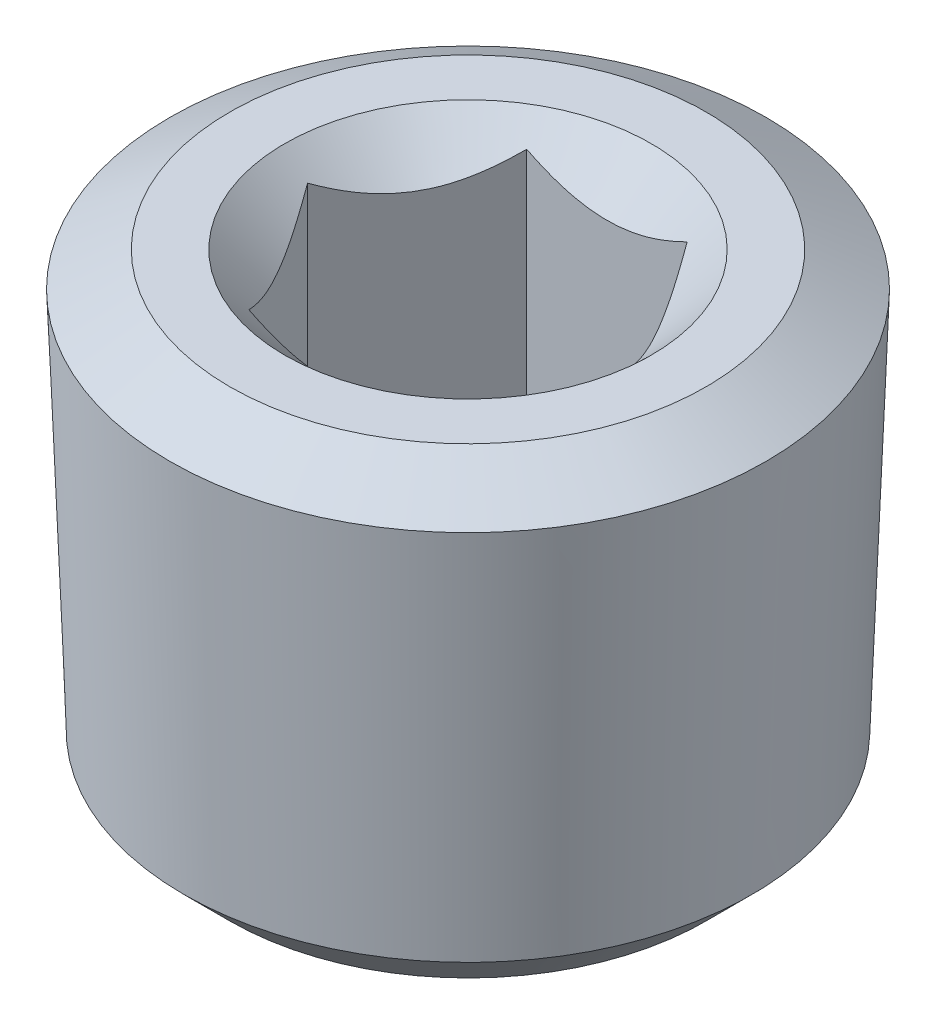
ISO-10303-21;
HEADER;
FILE_DESCRIPTION(('STEP AP214'),'2;1');
FILE_NAME('part.step','',(''),(''),'','','');
FILE_SCHEMA(('AUTOMOTIVE_DESIGN { 1 0 10303 214 1 1 1 1 }'));
ENDSEC;
DATA;
#1=APPLICATION_CONTEXT('core data for automotive mechanical design processes');
#2=APPLICATION_PROTOCOL_DEFINITION('international standard','automotive_design',2000,#1);
#3=PRODUCT_CONTEXT('',#1,'mechanical');
#4=PRODUCT('Part','Part','',(#3));
#5=PRODUCT_RELATED_PRODUCT_CATEGORY('part','',(#4));
#6=PRODUCT_DEFINITION_FORMATION('','',#4);
#7=PRODUCT_DEFINITION_CONTEXT('part definition',#1,'design');
#8=PRODUCT_DEFINITION('design','',#6,#7);
#9=PRODUCT_DEFINITION_SHAPE('','',#8);
#10=(LENGTH_UNIT() NAMED_UNIT(*) SI_UNIT(.MILLI.,.METRE.));
#11=(NAMED_UNIT(*) PLANE_ANGLE_UNIT() SI_UNIT($,.RADIAN.));
#12=(NAMED_UNIT(*) SI_UNIT($,.STERADIAN.) SOLID_ANGLE_UNIT());
#13=UNCERTAINTY_MEASURE_WITH_UNIT(LENGTH_MEASURE(1.E-05),#10,'distance_accuracy_value','');
#14=(GEOMETRIC_REPRESENTATION_CONTEXT(3) GLOBAL_UNCERTAINTY_ASSIGNED_CONTEXT((#13)) GLOBAL_UNIT_ASSIGNED_CONTEXT((#10,
#11,#12)) REPRESENTATION_CONTEXT('',''));
#15=CARTESIAN_POINT('',(0.,0.,0.));
#16=DIRECTION('',(0.,0.,1.));
#17=DIRECTION('',(1.,0.,0.));
#18=AXIS2_PLACEMENT_3D('',#15,#16,#17);
#19=CARTESIAN_POINT('',(0.,0.,0.));
#20=DIRECTION('',(0.,1.,0.));
#21=DIRECTION('',(0.,0.,1.));
#22=AXIS2_PLACEMENT_3D('',#19,#20,#21);
#23=PLANE('',#22);
#24=CARTESIAN_POINT('',(0.,0.,0.));
#25=DIRECTION('',(0.,1.,0.));
#26=DIRECTION('',(0.,0.,1.));
#27=AXIS2_PLACEMENT_3D('',#24,#25,#26);
#28=CIRCLE('',#27,3.1496);
#29=CARTESIAN_POINT('',(0.,0.,3.1496));
#30=VERTEX_POINT('',#29);
#31=EDGE_CURVE('E238',#30,#30,#28,.T.);
#32=ORIENTED_EDGE('',*,*,#31,.F.);
#33=EDGE_LOOP('',(#32));
#34=FACE_BOUND('',#33,.T.);
#35=CARTESIAN_POINT('',(0.,0.,0.));
#36=DIRECTION('',(0.,1.,0.));
#37=DIRECTION('',(0.,0.,1.));
#38=AXIS2_PLACEMENT_3D('',#35,#36,#37);
#39=CIRCLE('',#38,4.09164671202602);
#40=CARTESIAN_POINT('',(0.,0.,4.09164671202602));
#41=VERTEX_POINT('',#40);
#42=EDGE_CURVE('E12',#41,#41,#39,.T.);
#43=ORIENTED_EDGE('',*,*,#42,.T.);
#44=EDGE_LOOP('',(#43));
#45=FACE_BOUND('',#44,.T.);
#46=ADVANCED_FACE('F33',(#34,#45),#23,.T.);
#47=CARTESIAN_POINT('',(0.,0.,0.));
#48=DIRECTION('',(0.,-1.,0.));
#49=DIRECTION('',(0.,0.,-1.));
#50=AXIS2_PLACEMENT_3D('',#47,#48,#49);
#51=CONICAL_SURFACE('',#50,4.09164671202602,1.0471975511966);
#52=CARTESIAN_POINT('',(0.,-0.594768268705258,0.));
#53=DIRECTION('',(0.,1.,0.));
#54=DIRECTION('',(0.,0.,1.));
#55=AXIS2_PLACEMENT_3D('',#52,#53,#54);
#56=CIRCLE('',#55,5.1218155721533);
#57=CARTESIAN_POINT('',(0.,-0.594768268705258,5.1218155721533));
#58=VERTEX_POINT('',#57);
#59=EDGE_CURVE('E40',#58,#58,#56,.T.);
#60=ORIENTED_EDGE('',*,*,#59,.T.);
#61=EDGE_LOOP('',(#60));
#62=FACE_BOUND('',#61,.T.);
#63=ORIENTED_EDGE('',*,*,#42,.F.);
#64=EDGE_LOOP('',(#63));
#65=FACE_BOUND('',#64,.T.);
#66=ADVANCED_FACE('F228',(#62,#65),#51,.T.);
#67=CARTESIAN_POINT('',(0.,-0.594768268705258,0.));
#68=DIRECTION('',(0.,1.,0.));
#69=DIRECTION('',(0.,0.,1.));
#70=AXIS2_PLACEMENT_3D('',#67,#68,#69);
#71=CONICAL_SURFACE('',#70,5.1218155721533,0.0364424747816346);
#72=CARTESIAN_POINT('',(0.,-7.15936733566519,0.));
#73=DIRECTION('',(0.,1.,0.));
#74=DIRECTION('',(0.,0.,1.));
#75=AXIS2_PLACEMENT_3D('',#72,#73,#74);
#76=CIRCLE('',#75,4.88247937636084);
#77=CARTESIAN_POINT('',(0.,-7.15936733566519,4.88247937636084));
#78=VERTEX_POINT('',#77);
#79=EDGE_CURVE('E246',#78,#78,#76,.T.);
#80=ORIENTED_EDGE('',*,*,#79,.T.);
#81=EDGE_LOOP('',(#80));
#82=FACE_BOUND('',#81,.T.);
#83=ORIENTED_EDGE('',*,*,#59,.F.);
#84=EDGE_LOOP('',(#83));
#85=FACE_BOUND('',#84,.T.);
#86=ADVANCED_FACE('F233',(#82,#85),#71,.T.);
#87=CARTESIAN_POINT('',(0.,-7.15936733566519,0.));
#88=DIRECTION('',(0.,1.,0.));
#89=DIRECTION('',(0.,0.,1.));
#90=AXIS2_PLACEMENT_3D('',#87,#88,#89);
#91=CONICAL_SURFACE('',#90,4.88247937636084,0.785398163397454);
#92=CARTESIAN_POINT('',(0.,-7.9502,0.));
#93=DIRECTION('',(0.,1.,0.));
#94=DIRECTION('',(0.,0.,1.));
#95=AXIS2_PLACEMENT_3D('',#92,#93,#94);
#96=CIRCLE('',#95,4.09164671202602);
#97=CARTESIAN_POINT('',(0.,-7.9502,4.09164671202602));
#98=VERTEX_POINT('',#97);
#99=EDGE_CURVE('E242',#98,#98,#96,.T.);
#100=ORIENTED_EDGE('',*,*,#99,.T.);
#101=EDGE_LOOP('',(#100));
#102=FACE_BOUND('',#101,.T.);
#103=ORIENTED_EDGE('',*,*,#79,.F.);
#104=EDGE_LOOP('',(#103));
#105=FACE_BOUND('',#104,.T.);
#106=ADVANCED_FACE('F257',(#102,#105),#91,.T.);
#107=CARTESIAN_POINT('',(-4.09164671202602,-7.9502,0.));
#108=DIRECTION('',(0.,-1.,0.));
#109=DIRECTION('',(0.,0.,-1.));
#110=AXIS2_PLACEMENT_3D('',#107,#108,#109);
#111=PLANE('',#110);
#112=ORIENTED_EDGE('',*,*,#99,.F.);
#113=EDGE_LOOP('',(#112));
#114=FACE_BOUND('',#113,.T.);
#115=ADVANCED_FACE('F175',(#114),#111,.T.);
#116=CARTESIAN_POINT('',(0.,0.,0.));
#117=DIRECTION('',(0.,1.,0.));
#118=DIRECTION('',(0.,0.,1.));
#119=AXIS2_PLACEMENT_3D('',#116,#117,#118);
#120=CONICAL_SURFACE('',#119,3.1496,0.785398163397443);
#121=CARTESIAN_POINT('',(-3.46242077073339,1.05622826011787,2.3876));
#122=CARTESIAN_POINT('',(-3.37526911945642,0.984499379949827,2.3876));
#123=CARTESIAN_POINT('',(-3.28770245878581,0.913266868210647,2.3876));
#124=CARTESIAN_POINT('',(-3.11152582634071,0.772059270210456,2.3876));
#125=CARTESIAN_POINT('',(-3.02291559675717,0.702084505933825,2.3876));
#126=CARTESIAN_POINT('',(-2.84349874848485,0.562930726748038,2.3876));
#127=CARTESIAN_POINT('',(-2.75267868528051,0.493768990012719,2.3876));
#128=CARTESIAN_POINT('',(-2.56954860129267,0.357460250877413,2.3876));
#129=CARTESIAN_POINT('',(-2.47723872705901,0.290313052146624,2.3876));
#130=CARTESIAN_POINT('',(-2.28188792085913,0.152280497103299,2.3876));
#131=CARTESIAN_POINT('',(-2.17866480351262,0.0816515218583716,2.3876));
#132=CARTESIAN_POINT('',(-1.96947715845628,-0.0555359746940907,2.3876));
#133=CARTESIAN_POINT('',(-1.86351173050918,-0.122093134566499,2.3876));
#134=CARTESIAN_POINT('',(-1.64874800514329,-0.249332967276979,2.3876));
#135=CARTESIAN_POINT('',(-1.53996523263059,-0.310041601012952,2.3876));
#136=CARTESIAN_POINT('',(-1.31849805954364,-0.423788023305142,2.3876));
#137=CARTESIAN_POINT('',(-1.20581720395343,-0.476832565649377,2.3876));
#138=CARTESIAN_POINT('',(-1.00970710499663,-0.558326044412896,2.3876));
#139=CARTESIAN_POINT('',(-0.92738768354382,-0.589426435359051,2.3876));
#140=CARTESIAN_POINT('',(-0.760502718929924,-0.645041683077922,2.3876));
#141=CARTESIAN_POINT('',(-0.675936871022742,-0.669555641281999,2.3876));
#142=CARTESIAN_POINT('',(-0.506786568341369,-0.710155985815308,2.3876));
#143=CARTESIAN_POINT('',(-0.422245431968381,-0.726419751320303,2.3876));
#144=CARTESIAN_POINT('',(-0.251935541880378,-0.750223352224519,2.3876));
#145=CARTESIAN_POINT('',(-0.166167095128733,-0.757765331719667,2.3876));
#146=CARTESIAN_POINT('',(0.00107034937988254,-0.763383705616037,2.3876));
#147=CARTESIAN_POINT('',(0.0825230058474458,-0.761946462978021,2.3876));
#148=CARTESIAN_POINT('',(0.244859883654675,-0.750844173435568,2.3876));
#149=CARTESIAN_POINT('',(0.325744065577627,-0.741178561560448,2.3876));
#150=CARTESIAN_POINT('',(0.487775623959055,-0.71402033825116,2.3876));
#151=CARTESIAN_POINT('',(0.568897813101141,-0.696379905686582,2.3876));
#152=CARTESIAN_POINT('',(0.729317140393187,-0.654295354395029,2.3876));
#153=CARTESIAN_POINT('',(0.808614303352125,-0.629851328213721,2.3876));
#154=CARTESIAN_POINT('',(1.04680074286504,-0.546928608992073,2.3876));
#155=CARTESIAN_POINT('',(1.20258605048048,-0.479514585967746,2.3876));
#156=CARTESIAN_POINT('',(1.43061079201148,-0.36699056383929,2.3876));
#157=CARTESIAN_POINT('',(1.50581378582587,-0.32749643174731,2.3876));
#158=CARTESIAN_POINT('',(1.65452246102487,-0.245425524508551,2.3876));
#159=CARTESIAN_POINT('',(1.72802843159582,-0.202849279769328,2.3876));
#160=CARTESIAN_POINT('',(1.86994165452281,-0.117394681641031,2.3876));
#161=CARTESIAN_POINT('',(1.93842134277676,-0.0746352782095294,2.3876));
#162=CARTESIAN_POINT('',(2.07420549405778,0.0127190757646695,2.3876));
#163=CARTESIAN_POINT('',(2.14150986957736,0.0573141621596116,2.3876));
#164=CARTESIAN_POINT('',(2.27455924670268,0.147653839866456,2.3876));
#165=CARTESIAN_POINT('',(2.34031238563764,0.19338649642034,2.3876));
#166=CARTESIAN_POINT('',(2.47091456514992,0.286088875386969,2.3876));
#167=CARTESIAN_POINT('',(2.53576384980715,0.333058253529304,2.3876));
#168=CARTESIAN_POINT('',(2.60023368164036,0.380534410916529,2.3876));
#169=B_SPLINE_CURVE_WITH_KNOTS('',3,(#121,#122,#123,#124,#125,#126,#127,#128,#129,#130,#131,
#132,#133,#134,#135,#136,#137,#138,#139,#140,#141,#142,#143,#144,#145,#146,#147,#148,#149,#150,
#151,#152,#153,#154,#155,#156,#157,#158,#159,#160,#161,#162,#163,#164,#165,#166,#167,#168),
.UNSPECIFIED.,.F.,.F.,(4,2,2,2,2,2,2,2,2,2,2,2,2,2,2,2,2,2,2,2,2,2,2,4),(0.,0.33862629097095,
0.677338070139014,1.01978408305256,1.3621966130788,1.73734628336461,2.11262070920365,
2.48614413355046,2.85933636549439,3.12311223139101,3.38692406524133,3.64479404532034,
3.90260061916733,4.14656864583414,4.39055342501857,4.6392589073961,4.88796100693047,
5.39563913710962,5.65044461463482,5.90520634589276,6.14737581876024,6.38956324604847,
6.62982819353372,6.87002695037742),.UNSPECIFIED.);
#170=CARTESIAN_POINT('',(1.37848150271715,-0.392636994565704,2.3876));
#171=VERTEX_POINT('',#170);
#172=CARTESIAN_POINT('',(-1.37848150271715,-0.392636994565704,2.3876));
#173=VERTEX_POINT('',#172);
#174=EDGE_CURVE('E47',#171,#173,#169,.F.);
#175=ORIENTED_EDGE('',*,*,#174,.T.);
#176=CARTESIAN_POINT('',(-1.37836603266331,-0.392521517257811,2.3878));
#177=CARTESIAN_POINT('',(-1.42575207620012,-0.439867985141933,2.30572496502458));
#178=CARTESIAN_POINT('',(-1.47393048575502,-0.484433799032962,2.22227751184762));
#179=CARTESIAN_POINT('',(-1.57217161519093,-0.566032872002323,2.05211888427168));
#180=CARTESIAN_POINT('',(-1.62224367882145,-0.603020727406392,1.96539152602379));
#181=CARTESIAN_POINT('',(-1.72321161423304,-0.666381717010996,1.79050993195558));
#182=CARTESIAN_POINT('',(-1.77408177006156,-0.692914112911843,1.70240023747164));
#183=CARTESIAN_POINT('',(-1.87694201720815,-0.733792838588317,1.52424106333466));
#184=CARTESIAN_POINT('',(-1.92892896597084,-0.748169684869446,1.4341970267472));
#185=CARTESIAN_POINT('',(-2.01852512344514,-0.761141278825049,1.27901192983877));
#186=CARTESIAN_POINT('',(-2.05601857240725,-0.763061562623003,1.2140713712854));
#187=CARTESIAN_POINT('',(-2.13094418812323,-0.759826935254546,1.08429639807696));
#188=CARTESIAN_POINT('',(-2.16837632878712,-0.754669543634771,1.01946202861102));
#189=CARTESIAN_POINT('',(-2.24288716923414,-0.737573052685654,0.89040546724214));
#190=CARTESIAN_POINT('',(-2.2799654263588,-0.725626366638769,0.826184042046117));
#191=CARTESIAN_POINT('',(-2.35348076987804,-0.695607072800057,0.698851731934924));
#192=CARTESIAN_POINT('',(-2.38991790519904,-0.677534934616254,0.635740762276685));
#193=CARTESIAN_POINT('',(-2.48325004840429,-0.623883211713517,0.474084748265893));
#194=CARTESIAN_POINT('',(-2.53956632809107,-0.584259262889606,0.376542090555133));
#195=CARTESIAN_POINT('',(-2.62237445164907,-0.517368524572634,0.233114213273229));
#196=CARTESIAN_POINT('',(-2.64966342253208,-0.493866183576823,0.1858483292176));
#197=CARTESIAN_POINT('',(-2.70373586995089,-0.444719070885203,0.092192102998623));
#198=CARTESIAN_POINT('',(-2.73051964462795,-0.419075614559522,0.0458012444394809));
#199=CARTESIAN_POINT('',(-2.75707847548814,-0.39252151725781,-0.000199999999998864));
#200=B_SPLINE_CURVE_WITH_KNOTS('',3,(#176,#177,#178,#179,#180,#181,#182,#183,#184,#185,#186,
#187,#188,#189,#190,#191,#192,#193,#194,#195,#196,#197,#198,#199),.UNSPECIFIED.,.F.,.F.,(4,2,2,
2,2,2,2,2,2,2,2,4),(0.,0.318042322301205,0.637937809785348,0.952752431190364,1.26677434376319,
1.49149028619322,1.71628500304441,1.94133141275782,2.16636057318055,2.52380766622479,
2.70204658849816,2.88017680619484),.UNSPECIFIED.);
#201=CARTESIAN_POINT('',(-2.7569630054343,-0.392636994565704,0.));
#202=VERTEX_POINT('',#201);
#203=EDGE_CURVE('E119',#173,#202,#200,.T.);
#204=ORIENTED_EDGE('',*,*,#203,.T.);
#205=CARTESIAN_POINT('',(-2.75707847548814,-0.39252151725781,0.000200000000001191));
#206=CARTESIAN_POINT('',(-2.70969243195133,-0.439867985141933,-0.0818750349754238));
#207=CARTESIAN_POINT('',(-2.66151402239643,-0.484433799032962,-0.165322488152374));
#208=CARTESIAN_POINT('',(-2.56327289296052,-0.566032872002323,-0.335481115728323));
#209=CARTESIAN_POINT('',(-2.51320082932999,-0.603020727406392,-0.422208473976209));
#210=CARTESIAN_POINT('',(-2.4122328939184,-0.666381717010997,-0.597090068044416));
#211=CARTESIAN_POINT('',(-2.36136273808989,-0.692914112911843,-0.685199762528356));
#212=CARTESIAN_POINT('',(-2.2585024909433,-0.733792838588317,-0.863358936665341));
#213=CARTESIAN_POINT('',(-2.2065155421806,-0.748169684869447,-0.953402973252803));
#214=CARTESIAN_POINT('',(-2.1169193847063,-0.76114127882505,-1.10858807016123));
#215=CARTESIAN_POINT('',(-2.07942593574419,-0.763061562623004,-1.1735286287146));
#216=CARTESIAN_POINT('',(-2.00450032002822,-0.759826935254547,-1.30330360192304));
#217=CARTESIAN_POINT('',(-1.96706817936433,-0.754669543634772,-1.36813797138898));
#218=CARTESIAN_POINT('',(-1.89255733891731,-0.737573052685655,-1.49719453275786));
#219=CARTESIAN_POINT('',(-1.85547908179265,-0.725626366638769,-1.56141595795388));
#220=CARTESIAN_POINT('',(-1.78196373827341,-0.695607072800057,-1.68874826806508));
#221=CARTESIAN_POINT('',(-1.74552660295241,-0.677534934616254,-1.75185923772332));
#222=CARTESIAN_POINT('',(-1.65219445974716,-0.623883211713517,-1.91351525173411));
#223=CARTESIAN_POINT('',(-1.59587818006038,-0.584259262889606,-2.01105790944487));
#224=CARTESIAN_POINT('',(-1.51307005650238,-0.517368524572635,-2.15448578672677));
#225=CARTESIAN_POINT('',(-1.48578108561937,-0.493866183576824,-2.2017516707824));
#226=CARTESIAN_POINT('',(-1.43170863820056,-0.444719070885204,-2.29540789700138));
#227=CARTESIAN_POINT('',(-1.4049248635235,-0.419075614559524,-2.34179875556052));
#228=CARTESIAN_POINT('',(-1.37836603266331,-0.392521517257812,-2.3878));
#229=B_SPLINE_CURVE_WITH_KNOTS('',3,(#205,#206,#207,#208,#209,#210,#211,#212,#213,#214,#215,
#216,#217,#218,#219,#220,#221,#222,#223,#224,#225,#226,#227,#228),.UNSPECIFIED.,.F.,.F.,(4,2,2,
2,2,2,2,2,2,2,2,4),(0.,0.318042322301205,0.637937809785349,0.952752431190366,1.26677434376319,
1.49149028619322,1.71628500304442,1.94133141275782,2.16636057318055,2.52380766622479,
2.70204658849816,2.88017680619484),.UNSPECIFIED.);
#230=CARTESIAN_POINT('',(-1.37848150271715,-0.392636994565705,-2.3876));
#231=VERTEX_POINT('',#230);
#232=EDGE_CURVE('E197',#202,#231,#229,.T.);
#233=ORIENTED_EDGE('',*,*,#232,.T.);
#234=CARTESIAN_POINT('',(-3.46242077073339,1.05622826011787,-2.3876));
#235=CARTESIAN_POINT('',(-3.37526911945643,0.984499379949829,-2.3876));
#236=CARTESIAN_POINT('',(-3.28770245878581,0.91326686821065,-2.3876));
#237=CARTESIAN_POINT('',(-3.11152582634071,0.772059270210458,-2.3876));
#238=CARTESIAN_POINT('',(-3.02291559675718,0.702084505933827,-2.3876));
#239=CARTESIAN_POINT('',(-2.84349874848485,0.56293072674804,-2.3876));
#240=CARTESIAN_POINT('',(-2.75267868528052,0.49376899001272,-2.3876));
#241=CARTESIAN_POINT('',(-2.56954860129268,0.357460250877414,-2.3876));
#242=CARTESIAN_POINT('',(-2.47723872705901,0.290313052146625,-2.3876));
#243=CARTESIAN_POINT('',(-2.28188792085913,0.1522804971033,-2.3876));
#244=CARTESIAN_POINT('',(-2.17866480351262,0.081651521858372,-2.3876));
#245=CARTESIAN_POINT('',(-1.96947715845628,-0.0555359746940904,-2.3876));
#246=CARTESIAN_POINT('',(-1.86351173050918,-0.122093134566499,-2.3876));
#247=CARTESIAN_POINT('',(-1.64874800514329,-0.249332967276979,-2.3876));
#248=CARTESIAN_POINT('',(-1.53996523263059,-0.310041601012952,-2.3876));
#249=CARTESIAN_POINT('',(-1.31849805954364,-0.423788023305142,-2.3876));
#250=CARTESIAN_POINT('',(-1.20581720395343,-0.476832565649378,-2.3876));
#251=CARTESIAN_POINT('',(-1.00970710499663,-0.558326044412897,-2.3876));
#252=CARTESIAN_POINT('',(-0.92738768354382,-0.589426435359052,-2.3876));
#253=CARTESIAN_POINT('',(-0.760502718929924,-0.645041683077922,-2.3876));
#254=CARTESIAN_POINT('',(-0.675936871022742,-0.669555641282,-2.3876));
#255=CARTESIAN_POINT('',(-0.506786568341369,-0.710155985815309,-2.3876));
#256=CARTESIAN_POINT('',(-0.422245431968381,-0.726419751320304,-2.3876));
#257=CARTESIAN_POINT('',(-0.251935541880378,-0.750223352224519,-2.3876));
#258=CARTESIAN_POINT('',(-0.166167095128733,-0.757765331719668,-2.3876));
#259=CARTESIAN_POINT('',(0.00107034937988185,-0.763383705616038,-2.3876));
#260=CARTESIAN_POINT('',(0.0825230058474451,-0.761946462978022,-2.3876));
#261=CARTESIAN_POINT('',(0.244859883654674,-0.750844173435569,-2.3876));
#262=CARTESIAN_POINT('',(0.325744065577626,-0.741178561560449,-2.3876));
#263=CARTESIAN_POINT('',(0.487775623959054,-0.714020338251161,-2.3876));
#264=CARTESIAN_POINT('',(0.56889781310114,-0.696379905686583,-2.3876));
#265=CARTESIAN_POINT('',(0.729317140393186,-0.65429535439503,-2.3876));
#266=CARTESIAN_POINT('',(0.808614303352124,-0.629851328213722,-2.3876));
#267=CARTESIAN_POINT('',(1.04680074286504,-0.546928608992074,-2.3876));
#268=CARTESIAN_POINT('',(1.20258605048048,-0.479514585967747,-2.3876));
#269=CARTESIAN_POINT('',(1.43061079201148,-0.366990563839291,-2.3876));
#270=CARTESIAN_POINT('',(1.50581378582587,-0.327496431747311,-2.3876));
#271=CARTESIAN_POINT('',(1.65452246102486,-0.245425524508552,-2.3876));
#272=CARTESIAN_POINT('',(1.72802843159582,-0.202849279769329,-2.3876));
#273=CARTESIAN_POINT('',(1.86994165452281,-0.117394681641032,-2.3876));
#274=CARTESIAN_POINT('',(1.93842134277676,-0.0746352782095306,-2.3876));
#275=CARTESIAN_POINT('',(2.07420549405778,0.0127190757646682,-2.3876));
#276=CARTESIAN_POINT('',(2.14150986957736,0.0573141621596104,-2.3876));
#277=CARTESIAN_POINT('',(2.27455924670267,0.147653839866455,-2.3876));
#278=CARTESIAN_POINT('',(2.34031238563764,0.193386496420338,-2.3876));
#279=CARTESIAN_POINT('',(2.47091456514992,0.286088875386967,-2.3876));
#280=CARTESIAN_POINT('',(2.53576384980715,0.333058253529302,-2.3876));
#281=CARTESIAN_POINT('',(2.60023368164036,0.380534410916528,-2.3876));
#282=B_SPLINE_CURVE_WITH_KNOTS('',3,(#234,#235,#236,#237,#238,#239,#240,#241,#242,#243,#244,
#245,#246,#247,#248,#249,#250,#251,#252,#253,#254,#255,#256,#257,#258,#259,#260,#261,#262,#263,
#264,#265,#266,#267,#268,#269,#270,#271,#272,#273,#274,#275,#276,#277,#278,#279,#280,#281),
.UNSPECIFIED.,.F.,.F.,(4,2,2,2,2,2,2,2,2,2,2,2,2,2,2,2,2,2,2,2,2,2,2,4),(0.,0.338626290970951,
0.677338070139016,1.01978408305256,1.3621966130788,1.73734628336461,2.11262070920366,
2.48614413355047,2.85933636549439,3.12311223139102,3.38692406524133,3.64479404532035,
3.90260061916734,4.14656864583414,4.39055342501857,4.6392589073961,4.88796100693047,
5.39563913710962,5.65044461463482,5.90520634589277,6.14737581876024,6.38956324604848,
6.62982819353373,6.87002695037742),.UNSPECIFIED.);
#283=CARTESIAN_POINT('',(1.37848150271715,-0.392636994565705,-2.3876));
#284=VERTEX_POINT('',#283);
#285=EDGE_CURVE('E191',#231,#284,#282,.T.);
#286=ORIENTED_EDGE('',*,*,#285,.T.);
#287=CARTESIAN_POINT('',(1.37836603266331,-0.392521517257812,-2.3878));
#288=CARTESIAN_POINT('',(1.42575207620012,-0.439867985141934,-2.30572496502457));
#289=CARTESIAN_POINT('',(1.47393048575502,-0.484433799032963,-2.22227751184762));
#290=CARTESIAN_POINT('',(1.57217161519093,-0.566032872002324,-2.05211888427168));
#291=CARTESIAN_POINT('',(1.62224367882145,-0.603020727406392,-1.96539152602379));
#292=CARTESIAN_POINT('',(1.72321161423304,-0.666381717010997,-1.79050993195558));
#293=CARTESIAN_POINT('',(1.77408177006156,-0.692914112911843,-1.70240023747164));
#294=CARTESIAN_POINT('',(1.87694201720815,-0.733792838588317,-1.52424106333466));
#295=CARTESIAN_POINT('',(1.92892896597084,-0.748169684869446,-1.4341970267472));
#296=CARTESIAN_POINT('',(2.01852512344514,-0.761141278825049,-1.27901192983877));
#297=CARTESIAN_POINT('',(2.05601857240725,-0.763061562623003,-1.2140713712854));
#298=CARTESIAN_POINT('',(2.13094418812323,-0.759826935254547,-1.08429639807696));
#299=CARTESIAN_POINT('',(2.16837632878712,-0.754669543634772,-1.01946202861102));
#300=CARTESIAN_POINT('',(2.24288716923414,-0.737573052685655,-0.89040546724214));
#301=CARTESIAN_POINT('',(2.2799654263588,-0.725626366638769,-0.826184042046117));
#302=CARTESIAN_POINT('',(2.35348076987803,-0.695607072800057,-0.698851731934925));
#303=CARTESIAN_POINT('',(2.38991790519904,-0.677534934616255,-0.635740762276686));
#304=CARTESIAN_POINT('',(2.48325004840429,-0.623883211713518,-0.474084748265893));
#305=CARTESIAN_POINT('',(2.53956632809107,-0.584259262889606,-0.376542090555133));
#306=CARTESIAN_POINT('',(2.62237445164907,-0.517368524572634,-0.233114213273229));
#307=CARTESIAN_POINT('',(2.64966342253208,-0.493866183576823,-0.1858483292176));
#308=CARTESIAN_POINT('',(2.70373586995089,-0.444719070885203,-0.0921921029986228));
#309=CARTESIAN_POINT('',(2.73051964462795,-0.419075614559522,-0.0458012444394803));
#310=CARTESIAN_POINT('',(2.75707847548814,-0.39252151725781,0.000199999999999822));
#311=B_SPLINE_CURVE_WITH_KNOTS('',3,(#287,#288,#289,#290,#291,#292,#293,#294,#295,#296,#297,
#298,#299,#300,#301,#302,#303,#304,#305,#306,#307,#308,#309,#310),.UNSPECIFIED.,.F.,.F.,(4,2,2,
2,2,2,2,2,2,2,2,4),(0.,0.318042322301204,0.637937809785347,0.952752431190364,1.26677434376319,
1.49149028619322,1.71628500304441,1.94133141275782,2.16636057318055,2.52380766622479,
2.70204658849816,2.88017680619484),.UNSPECIFIED.);
#312=CARTESIAN_POINT('',(2.7569630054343,-0.392636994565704,0.));
#313=VERTEX_POINT('',#312);
#314=EDGE_CURVE('E185',#284,#313,#311,.T.);
#315=ORIENTED_EDGE('',*,*,#314,.T.);
#316=CARTESIAN_POINT('',(2.75707847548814,-0.39252151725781,-0.000200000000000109));
#317=CARTESIAN_POINT('',(2.70969243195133,-0.439867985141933,0.0818750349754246));
#318=CARTESIAN_POINT('',(2.66151402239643,-0.484433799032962,0.165322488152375));
#319=CARTESIAN_POINT('',(2.56327289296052,-0.566032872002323,0.335481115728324));
#320=CARTESIAN_POINT('',(2.51320082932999,-0.603020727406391,0.422208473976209));
#321=CARTESIAN_POINT('',(2.4122328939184,-0.666381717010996,0.597090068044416));
#322=CARTESIAN_POINT('',(2.36136273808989,-0.692914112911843,0.685199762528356));
#323=CARTESIAN_POINT('',(2.2585024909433,-0.733792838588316,0.863358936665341));
#324=CARTESIAN_POINT('',(2.20651554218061,-0.748169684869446,0.953402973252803));
#325=CARTESIAN_POINT('',(2.11691938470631,-0.761141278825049,1.10858807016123));
#326=CARTESIAN_POINT('',(2.0794259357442,-0.763061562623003,1.1735286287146));
#327=CARTESIAN_POINT('',(2.00450032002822,-0.759826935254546,1.30330360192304));
#328=CARTESIAN_POINT('',(1.96706817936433,-0.754669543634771,1.36813797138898));
#329=CARTESIAN_POINT('',(1.89255733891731,-0.737573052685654,1.49719453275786));
#330=CARTESIAN_POINT('',(1.85547908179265,-0.725626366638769,1.56141595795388));
#331=CARTESIAN_POINT('',(1.78196373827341,-0.695607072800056,1.68874826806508));
#332=CARTESIAN_POINT('',(1.74552660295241,-0.677534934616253,1.75185923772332));
#333=CARTESIAN_POINT('',(1.65219445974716,-0.623883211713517,1.91351525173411));
#334=CARTESIAN_POINT('',(1.59587818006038,-0.584259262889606,2.01105790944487));
#335=CARTESIAN_POINT('',(1.51307005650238,-0.517368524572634,2.15448578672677));
#336=CARTESIAN_POINT('',(1.48578108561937,-0.493866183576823,2.2017516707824));
#337=CARTESIAN_POINT('',(1.43170863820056,-0.444719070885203,2.29540789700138));
#338=CARTESIAN_POINT('',(1.4049248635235,-0.419075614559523,2.34179875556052));
#339=CARTESIAN_POINT('',(1.37836603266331,-0.39252151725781,2.3878));
#340=B_SPLINE_CURVE_WITH_KNOTS('',3,(#316,#317,#318,#319,#320,#321,#322,#323,#324,#325,#326,
#327,#328,#329,#330,#331,#332,#333,#334,#335,#336,#337,#338,#339),.UNSPECIFIED.,.F.,.F.,(4,2,2,
2,2,2,2,2,2,2,2,4),(0.,0.318042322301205,0.637937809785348,0.952752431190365,1.26677434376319,
1.49149028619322,1.71628500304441,1.94133141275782,2.16636057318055,2.52380766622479,
2.70204658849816,2.88017680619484),.UNSPECIFIED.);
#341=EDGE_CURVE('E162',#313,#171,#340,.T.);
#342=ORIENTED_EDGE('',*,*,#341,.T.);
#343=EDGE_LOOP('',(#175,#204,#233,#286,#315,#342));
#344=FACE_BOUND('',#343,.T.);
#345=ORIENTED_EDGE('',*,*,#31,.T.);
#346=EDGE_LOOP('',(#345));
#347=FACE_BOUND('',#346,.T.);
#348=ADVANCED_FACE('F170',(#344,#347),#120,.F.);
#349=CARTESIAN_POINT('',(-2.7569630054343,-6.35,0.));
#350=DIRECTION('',(-0.866025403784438,0.,0.5));
#351=DIRECTION('',(0.500000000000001,0.,0.866025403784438));
#352=AXIS2_PLACEMENT_3D('',#349,#350,#351);
#353=PLANE('',#352);
#354=DIRECTION('',(0.,1.,0.));
#355=VECTOR('',#354,1.);
#356=CARTESIAN_POINT('',(-1.37848150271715,-6.35,2.3876));
#357=LINE('',#356,#355);
#358=CARTESIAN_POINT('',(-1.37848150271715,-6.35,2.3876));
#359=VERTEX_POINT('',#358);
#360=EDGE_CURVE('E116',#359,#173,#357,.T.);
#361=ORIENTED_EDGE('',*,*,#360,.F.);
#362=DIRECTION('',(0.5,0.,0.866025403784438));
#363=VECTOR('',#362,1.);
#364=CARTESIAN_POINT('',(-2.7569630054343,-6.35,0.));
#365=LINE('',#364,#363);
#366=CARTESIAN_POINT('',(-2.06772225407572,-6.35,1.1938));
#367=VERTEX_POINT('',#366);
#368=EDGE_CURVE('E103',#367,#359,#365,.T.);
#369=ORIENTED_EDGE('',*,*,#368,.F.);
#370=CARTESIAN_POINT('',(-2.7569630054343,-6.35,0.));
#371=VERTEX_POINT('',#370);
#372=EDGE_CURVE('E113',#371,#367,#365,.T.);
#373=ORIENTED_EDGE('',*,*,#372,.F.);
#374=DIRECTION('',(0.,1.,0.));
#375=VECTOR('',#374,1.);
#376=CARTESIAN_POINT('',(-2.7569630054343,-6.35,0.));
#377=LINE('',#376,#375);
#378=EDGE_CURVE('E143',#371,#202,#377,.T.);
#379=ORIENTED_EDGE('',*,*,#378,.T.);
#380=ORIENTED_EDGE('',*,*,#203,.F.);
#381=EDGE_LOOP('',(#361,#369,#373,#379,#380));
#382=FACE_BOUND('',#381,.T.);
#383=ADVANCED_FACE('F117',(#382),#353,.F.);
#384=CARTESIAN_POINT('',(-1.37848150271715,-6.35,-2.3876));
#385=DIRECTION('',(-0.866025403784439,0.,-0.5));
#386=DIRECTION('',(-0.5,0.,0.866025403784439));
#387=AXIS2_PLACEMENT_3D('',#384,#385,#386);
#388=PLANE('',#387);
#389=ORIENTED_EDGE('',*,*,#378,.F.);
#390=DIRECTION('',(-0.5,0.,0.866025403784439));
#391=VECTOR('',#390,1.);
#392=CARTESIAN_POINT('',(-1.37848150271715,-6.35,-2.3876));
#393=LINE('',#392,#391);
#394=CARTESIAN_POINT('',(-2.06772225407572,-6.35,-1.1938));
#395=VERTEX_POINT('',#394);
#396=EDGE_CURVE('E140',#395,#371,#393,.T.);
#397=ORIENTED_EDGE('',*,*,#396,.F.);
#398=CARTESIAN_POINT('',(-1.37848150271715,-6.35,-2.3876));
#399=VERTEX_POINT('',#398);
#400=EDGE_CURVE('E122',#399,#395,#393,.T.);
#401=ORIENTED_EDGE('',*,*,#400,.F.);
#402=DIRECTION('',(0.,1.,0.));
#403=VECTOR('',#402,1.);
#404=CARTESIAN_POINT('',(-1.37848150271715,-6.35,-2.3876));
#405=LINE('',#404,#403);
#406=EDGE_CURVE('E145',#399,#231,#405,.T.);
#407=ORIENTED_EDGE('',*,*,#406,.T.);
#408=ORIENTED_EDGE('',*,*,#232,.F.);
#409=EDGE_LOOP('',(#389,#397,#401,#407,#408));
#410=FACE_BOUND('',#409,.T.);
#411=ADVANCED_FACE('F206',(#410),#388,.F.);
#412=CARTESIAN_POINT('',(1.37848150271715,-6.35,-2.3876));
#413=DIRECTION('',(0.,0.,-1.));
#414=DIRECTION('',(-1.,0.,0.));
#415=AXIS2_PLACEMENT_3D('',#412,#413,#414);
#416=PLANE('',#415);
#417=ORIENTED_EDGE('',*,*,#406,.F.);
#418=DIRECTION('',(-1.,0.,0.));
#419=VECTOR('',#418,1.);
#420=CARTESIAN_POINT('',(1.37848150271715,-6.35,-2.3876));
#421=LINE('',#420,#419);
#422=CARTESIAN_POINT('',(0.,-6.35,-2.3876));
#423=VERTEX_POINT('',#422);
#424=EDGE_CURVE('E136',#423,#399,#421,.T.);
#425=ORIENTED_EDGE('',*,*,#424,.F.);
#426=CARTESIAN_POINT('',(1.37848150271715,-6.35,-2.3876));
#427=VERTEX_POINT('',#426);
#428=EDGE_CURVE('E137',#427,#423,#421,.T.);
#429=ORIENTED_EDGE('',*,*,#428,.F.);
#430=DIRECTION('',(0.,1.,0.));
#431=VECTOR('',#430,1.);
#432=CARTESIAN_POINT('',(1.37848150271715,-6.35,-2.3876));
#433=LINE('',#432,#431);
#434=EDGE_CURVE('E148',#427,#284,#433,.T.);
#435=ORIENTED_EDGE('',*,*,#434,.T.);
#436=ORIENTED_EDGE('',*,*,#285,.F.);
#437=EDGE_LOOP('',(#417,#425,#429,#435,#436));
#438=FACE_BOUND('',#437,.T.);
#439=ADVANCED_FACE('F210',(#438),#416,.F.);
#440=CARTESIAN_POINT('',(2.7569630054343,-6.35,0.));
#441=DIRECTION('',(0.866025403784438,0.,-0.5));
#442=DIRECTION('',(-0.5,0.,-0.866025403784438));
#443=AXIS2_PLACEMENT_3D('',#440,#441,#442);
#444=PLANE('',#443);
#445=ORIENTED_EDGE('',*,*,#434,.F.);
#446=DIRECTION('',(-0.5,0.,-0.866025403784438));
#447=VECTOR('',#446,1.);
#448=CARTESIAN_POINT('',(2.7569630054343,-6.35,0.));
#449=LINE('',#448,#447);
#450=CARTESIAN_POINT('',(2.06772225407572,-6.35,-1.1938));
#451=VERTEX_POINT('',#450);
#452=EDGE_CURVE('E132',#451,#427,#449,.T.);
#453=ORIENTED_EDGE('',*,*,#452,.F.);
#454=CARTESIAN_POINT('',(2.7569630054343,-6.35,0.));
#455=VERTEX_POINT('',#454);
#456=EDGE_CURVE('E133',#455,#451,#449,.T.);
#457=ORIENTED_EDGE('',*,*,#456,.F.);
#458=DIRECTION('',(0.,1.,0.));
#459=VECTOR('',#458,1.);
#460=CARTESIAN_POINT('',(2.7569630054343,-6.35,0.));
#461=LINE('',#460,#459);
#462=EDGE_CURVE('E151',#455,#313,#461,.T.);
#463=ORIENTED_EDGE('',*,*,#462,.T.);
#464=ORIENTED_EDGE('',*,*,#314,.F.);
#465=EDGE_LOOP('',(#445,#453,#457,#463,#464));
#466=FACE_BOUND('',#465,.T.);
#467=ADVANCED_FACE('F214',(#466),#444,.F.);
#468=CARTESIAN_POINT('',(1.37848150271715,-6.35,2.3876));
#469=DIRECTION('',(0.866025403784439,0.,0.5));
#470=DIRECTION('',(0.5,0.,-0.866025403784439));
#471=AXIS2_PLACEMENT_3D('',#468,#469,#470);
#472=PLANE('',#471);
#473=ORIENTED_EDGE('',*,*,#462,.F.);
#474=DIRECTION('',(0.5,0.,-0.866025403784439));
#475=VECTOR('',#474,1.);
#476=CARTESIAN_POINT('',(1.37848150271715,-6.35,2.3876));
#477=LINE('',#476,#475);
#478=CARTESIAN_POINT('',(2.06772225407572,-6.35,1.1938));
#479=VERTEX_POINT('',#478);
#480=EDGE_CURVE('E128',#479,#455,#477,.T.);
#481=ORIENTED_EDGE('',*,*,#480,.F.);
#482=CARTESIAN_POINT('',(1.37848150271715,-6.35,2.3876));
#483=VERTEX_POINT('',#482);
#484=EDGE_CURVE('E55',#483,#479,#477,.T.);
#485=ORIENTED_EDGE('',*,*,#484,.F.);
#486=DIRECTION('',(0.,1.,0.));
#487=VECTOR('',#486,1.);
#488=CARTESIAN_POINT('',(1.37848150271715,-6.35,2.3876));
#489=LINE('',#488,#487);
#490=EDGE_CURVE('E121',#483,#171,#489,.T.);
#491=ORIENTED_EDGE('',*,*,#490,.T.);
#492=ORIENTED_EDGE('',*,*,#341,.F.);
#493=EDGE_LOOP('',(#473,#481,#485,#491,#492));
#494=FACE_BOUND('',#493,.T.);
#495=ADVANCED_FACE('F218',(#494),#472,.F.);
#496=CARTESIAN_POINT('',(-1.37848150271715,-6.35,2.3876));
#497=DIRECTION('',(0.,0.,1.));
#498=DIRECTION('',(1.,0.,0.));
#499=AXIS2_PLACEMENT_3D('',#496,#497,#498);
#500=PLANE('',#499);
#501=ORIENTED_EDGE('',*,*,#490,.F.);
#502=DIRECTION('',(1.,0.,0.));
#503=VECTOR('',#502,1.);
#504=CARTESIAN_POINT('',(-1.37848150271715,-6.35,2.3876));
#505=LINE('',#504,#503);
#506=CARTESIAN_POINT('',(0.,-6.35,2.3876));
#507=VERTEX_POINT('',#506);
#508=EDGE_CURVE('E127',#507,#483,#505,.T.);
#509=ORIENTED_EDGE('',*,*,#508,.F.);
#510=EDGE_CURVE('E107',#359,#507,#505,.T.);
#511=ORIENTED_EDGE('',*,*,#510,.F.);
#512=ORIENTED_EDGE('',*,*,#360,.T.);
#513=ORIENTED_EDGE('',*,*,#174,.F.);
#514=EDGE_LOOP('',(#501,#509,#511,#512,#513));
#515=FACE_BOUND('',#514,.T.);
#516=ADVANCED_FACE('F126',(#515),#500,.F.);
#517=CARTESIAN_POINT('',(0.,-6.35,0.));
#518=DIRECTION('',(0.,1.,0.));
#519=DIRECTION('',(0.,0.,1.));
#520=AXIS2_PLACEMENT_3D('',#517,#518,#519);
#521=PLANE('',#520);
#522=CARTESIAN_POINT('',(0.,-6.35,0.));
#523=DIRECTION('',(0.,1.,0.));
#524=DIRECTION('',(0.,0.,1.));
#525=AXIS2_PLACEMENT_3D('',#522,#523,#524);
#526=CIRCLE('',#525,2.3876);
#527=EDGE_CURVE('E109',#367,#507,#526,.T.);
#528=ORIENTED_EDGE('',*,*,#527,.F.);
#529=ORIENTED_EDGE('',*,*,#368,.T.);
#530=ORIENTED_EDGE('',*,*,#510,.T.);
#531=EDGE_LOOP('',(#528,#529,#530));
#532=FACE_BOUND('',#531,.T.);
#533=ADVANCED_FACE('F105',(#532),#521,.T.);
#534=EDGE_CURVE('E408',#395,#367,#526,.T.);
#535=ORIENTED_EDGE('',*,*,#534,.F.);
#536=ORIENTED_EDGE('',*,*,#396,.T.);
#537=ORIENTED_EDGE('',*,*,#372,.T.);
#538=EDGE_LOOP('',(#535,#536,#537));
#539=FACE_BOUND('',#538,.T.);
#540=ADVANCED_FACE('F314',(#539),#521,.T.);
#541=EDGE_CURVE('E419',#423,#395,#526,.T.);
#542=ORIENTED_EDGE('',*,*,#541,.F.);
#543=ORIENTED_EDGE('',*,*,#424,.T.);
#544=ORIENTED_EDGE('',*,*,#400,.T.);
#545=EDGE_LOOP('',(#542,#543,#544));
#546=FACE_BOUND('',#545,.T.);
#547=ADVANCED_FACE('F323',(#546),#521,.T.);
#548=EDGE_CURVE('E420',#451,#423,#526,.T.);
#549=ORIENTED_EDGE('',*,*,#548,.F.);
#550=ORIENTED_EDGE('',*,*,#452,.T.);
#551=ORIENTED_EDGE('',*,*,#428,.T.);
#552=EDGE_LOOP('',(#549,#550,#551));
#553=FACE_BOUND('',#552,.T.);
#554=ADVANCED_FACE('F332',(#553),#521,.T.);
#555=EDGE_CURVE('E249',#479,#451,#526,.T.);
#556=ORIENTED_EDGE('',*,*,#555,.F.);
#557=ORIENTED_EDGE('',*,*,#480,.T.);
#558=ORIENTED_EDGE('',*,*,#456,.T.);
#559=EDGE_LOOP('',(#556,#557,#558));
#560=FACE_BOUND('',#559,.T.);
#561=ADVANCED_FACE('F341',(#560),#521,.T.);
#562=EDGE_CURVE('E243',#507,#479,#526,.T.);
#563=ORIENTED_EDGE('',*,*,#562,.F.);
#564=ORIENTED_EDGE('',*,*,#508,.T.);
#565=ORIENTED_EDGE('',*,*,#484,.T.);
#566=EDGE_LOOP('',(#563,#564,#565));
#567=FACE_BOUND('',#566,.T.);
#568=ADVANCED_FACE('F315',(#567),#521,.T.);
#569=CARTESIAN_POINT('',(-1.96487301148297,-6.604,0.));
#570=DIRECTION('',(0.,-1.,0.));
#571=DIRECTION('',(0.,0.,-1.));
#572=AXIS2_PLACEMENT_3D('',#569,#570,#571);
#573=PLANE('',#572);
#574=CARTESIAN_POINT('',(0.,-6.604,0.));
#575=DIRECTION('',(0.,1.,0.));
#576=DIRECTION('',(0.,0.,1.));
#577=AXIS2_PLACEMENT_3D('',#574,#575,#576);
#578=CIRCLE('',#577,1.96487301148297);
#579=CARTESIAN_POINT('',(0.,-6.604,1.96487301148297));
#580=VERTEX_POINT('',#579);
#581=EDGE_CURVE('E407',#580,#580,#578,.T.);
#582=ORIENTED_EDGE('',*,*,#581,.T.);
#583=EDGE_LOOP('',(#582));
#584=FACE_BOUND('',#583,.T.);
#585=ADVANCED_FACE('F358',(#584),#573,.F.);
#586=CARTESIAN_POINT('',(0.,-6.35,0.));
#587=DIRECTION('',(0.,1.,0.));
#588=DIRECTION('',(0.,0.,1.));
#589=AXIS2_PLACEMENT_3D('',#586,#587,#588);
#590=CONICAL_SURFACE('',#589,2.3876,1.02974425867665);
#591=ORIENTED_EDGE('',*,*,#581,.F.);
#592=EDGE_LOOP('',(#591));
#593=FACE_BOUND('',#592,.T.);
#594=ORIENTED_EDGE('',*,*,#562,.T.);
#595=ORIENTED_EDGE('',*,*,#555,.T.);
#596=ORIENTED_EDGE('',*,*,#548,.T.);
#597=ORIENTED_EDGE('',*,*,#541,.T.);
#598=ORIENTED_EDGE('',*,*,#534,.T.);
#599=ORIENTED_EDGE('',*,*,#527,.T.);
#600=EDGE_LOOP('',(#594,#595,#596,#597,#598,#599));
#601=FACE_BOUND('',#600,.T.);
#602=ADVANCED_FACE('F176',(#593,#601),#590,.F.);
#603=CLOSED_SHELL('',(#46,#66,#86,#106,#115,#348,#383,#411,#439,#467,#495,#516,#533,#540,#547,
#554,#561,#568,#585,#602));
#604=MANIFOLD_SOLID_BREP('B2',#603);
#605=ADVANCED_BREP_SHAPE_REPRESENTATION('',(#18,#604),#14);
#606=SHAPE_DEFINITION_REPRESENTATION(#9,#605);
ENDSEC;
END-ISO-10303-21;
